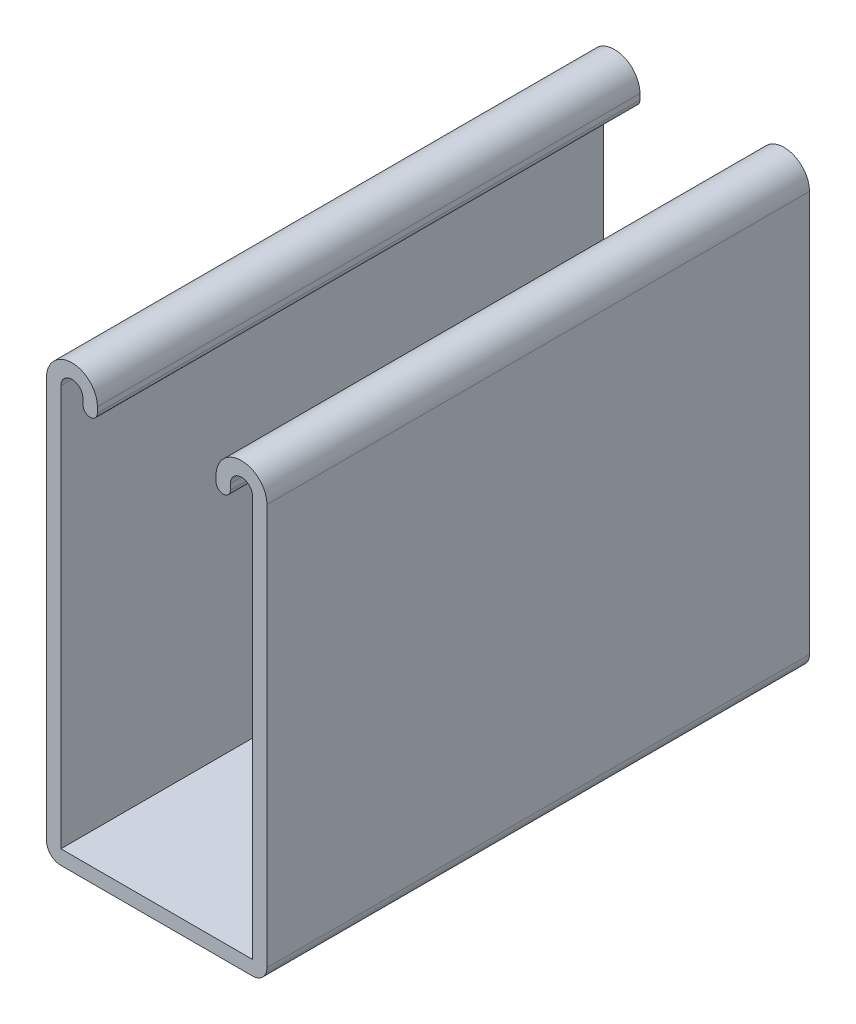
ISO-10303-21;
HEADER;
FILE_DESCRIPTION(('STEP AP214'),'2;1');
FILE_NAME('part.step','',(''),(''),'','','');
FILE_SCHEMA(('AUTOMOTIVE_DESIGN { 1 0 10303 214 1 1 1 1 }'));
ENDSEC;
DATA;
#1=APPLICATION_CONTEXT('core data for automotive mechanical design processes');
#2=APPLICATION_PROTOCOL_DEFINITION('international standard','automotive_design',2000,#1);
#3=PRODUCT_CONTEXT('',#1,'mechanical');
#4=PRODUCT('Part','Part','',(#3));
#5=PRODUCT_RELATED_PRODUCT_CATEGORY('part','',(#4));
#6=PRODUCT_DEFINITION_FORMATION('','',#4);
#7=PRODUCT_DEFINITION_CONTEXT('part definition',#1,'design');
#8=PRODUCT_DEFINITION('design','',#6,#7);
#9=PRODUCT_DEFINITION_SHAPE('','',#8);
#10=(LENGTH_UNIT() NAMED_UNIT(*) SI_UNIT(.MILLI.,.METRE.));
#11=(NAMED_UNIT(*) PLANE_ANGLE_UNIT() SI_UNIT($,.RADIAN.));
#12=(NAMED_UNIT(*) SI_UNIT($,.STERADIAN.) SOLID_ANGLE_UNIT());
#13=UNCERTAINTY_MEASURE_WITH_UNIT(LENGTH_MEASURE(1.E-05),#10,'distance_accuracy_value','');
#14=(GEOMETRIC_REPRESENTATION_CONTEXT(3) GLOBAL_UNCERTAINTY_ASSIGNED_CONTEXT((#13)) GLOBAL_UNIT_ASSIGNED_CONTEXT((#10,
#11,#12)) REPRESENTATION_CONTEXT('',''));
#15=CARTESIAN_POINT('',(0.,0.,0.));
#16=DIRECTION('',(0.,0.,1.));
#17=DIRECTION('',(1.,0.,0.));
#18=AXIS2_PLACEMENT_3D('',#15,#16,#17);
#19=CARTESIAN_POINT('',(-15.875,39.6875,101.6));
#20=DIRECTION('',(0.,0.,-1.));
#21=DIRECTION('',(-1.,0.,0.));
#22=AXIS2_PLACEMENT_3D('',#19,#20,#21);
#23=CYLINDRICAL_SURFACE('',#22,4.7625);
#24=CARTESIAN_POINT('',(-15.875,39.6875,0.));
#25=DIRECTION('',(0.,0.,1.));
#26=DIRECTION('',(-1.,0.,0.));
#27=AXIS2_PLACEMENT_3D('',#24,#25,#26);
#28=CIRCLE('',#27,4.7625);
#29=CARTESIAN_POINT('',(-11.1125,39.6875,0.));
#30=VERTEX_POINT('',#29);
#31=CARTESIAN_POINT('',(-20.6375,39.6875,0.));
#32=VERTEX_POINT('',#31);
#33=EDGE_CURVE('E190',#30,#32,#28,.T.);
#34=ORIENTED_EDGE('',*,*,#33,.T.);
#35=DIRECTION('',(0.,0.,-1.));
#36=VECTOR('',#35,1.);
#37=CARTESIAN_POINT('',(-20.6375,39.6875,101.6));
#38=LINE('',#37,#36);
#39=CARTESIAN_POINT('',(-20.6375,39.6875,101.6));
#40=VERTEX_POINT('',#39);
#41=EDGE_CURVE('E11',#40,#32,#38,.T.);
#42=ORIENTED_EDGE('',*,*,#41,.F.);
#43=CARTESIAN_POINT('',(-15.875,39.6875,101.6));
#44=DIRECTION('',(0.,0.,1.));
#45=DIRECTION('',(-1.,0.,0.));
#46=AXIS2_PLACEMENT_3D('',#43,#44,#45);
#47=CIRCLE('',#46,4.7625);
#48=CARTESIAN_POINT('',(-11.1125,39.6875,101.6));
#49=VERTEX_POINT('',#48);
#50=EDGE_CURVE('E224',#49,#40,#47,.T.);
#51=ORIENTED_EDGE('',*,*,#50,.F.);
#52=DIRECTION('',(0.,0.,-1.));
#53=VECTOR('',#52,1.);
#54=CARTESIAN_POINT('',(-11.1125,39.6875,101.6));
#55=LINE('',#54,#53);
#56=EDGE_CURVE('E186',#49,#30,#55,.T.);
#57=ORIENTED_EDGE('',*,*,#56,.T.);
#58=EDGE_LOOP('',(#34,#42,#51,#57));
#59=FACE_BOUND('',#58,.T.);
#60=ADVANCED_FACE('F33',(#59),#23,.T.);
#61=CARTESIAN_POINT('',(-20.6375,39.6875,101.6));
#62=DIRECTION('',(1.,0.,0.));
#63=DIRECTION('',(0.,1.,0.));
#64=AXIS2_PLACEMENT_3D('',#61,#62,#63);
#65=PLANE('',#64);
#66=DIRECTION('',(0.,-1.,0.));
#67=VECTOR('',#66,1.);
#68=CARTESIAN_POINT('',(-20.6375,39.6875,0.));
#69=LINE('',#68,#67);
#70=CARTESIAN_POINT('',(-20.6375,-35.4076,0.));
#71=VERTEX_POINT('',#70);
#72=EDGE_CURVE('E193',#32,#71,#69,.T.);
#73=ORIENTED_EDGE('',*,*,#72,.T.);
#74=DIRECTION('',(0.,0.,-1.));
#75=VECTOR('',#74,1.);
#76=CARTESIAN_POINT('',(-20.6375,-35.4076,101.6));
#77=LINE('',#76,#75);
#78=CARTESIAN_POINT('',(-20.6375,-35.4076,101.6));
#79=VERTEX_POINT('',#78);
#80=EDGE_CURVE('E42',#79,#71,#77,.T.);
#81=ORIENTED_EDGE('',*,*,#80,.F.);
#82=DIRECTION('',(0.,-1.,0.));
#83=VECTOR('',#82,1.);
#84=CARTESIAN_POINT('',(-20.6375,39.6875,101.6));
#85=LINE('',#84,#83);
#86=EDGE_CURVE('E123',#40,#79,#85,.T.);
#87=ORIENTED_EDGE('',*,*,#86,.F.);
#88=ORIENTED_EDGE('',*,*,#41,.T.);
#89=EDGE_LOOP('',(#73,#81,#87,#88));
#90=FACE_BOUND('',#89,.T.);
#91=ADVANCED_FACE('F333',(#90),#65,.F.);
#92=CARTESIAN_POINT('',(-17.9451,-35.4076,101.6));
#93=DIRECTION('',(0.,0.,-1.));
#94=DIRECTION('',(-1.,0.,0.));
#95=AXIS2_PLACEMENT_3D('',#92,#93,#94);
#96=CYLINDRICAL_SURFACE('',#95,2.6924);
#97=CARTESIAN_POINT('',(-17.9451,-35.4076,0.));
#98=DIRECTION('',(0.,0.,1.));
#99=DIRECTION('',(-1.,0.,0.));
#100=AXIS2_PLACEMENT_3D('',#97,#98,#99);
#101=CIRCLE('',#100,2.6924);
#102=CARTESIAN_POINT('',(-17.9451,-38.1,0.));
#103=VERTEX_POINT('',#102);
#104=EDGE_CURVE('E195',#71,#103,#101,.T.);
#105=ORIENTED_EDGE('',*,*,#104,.T.);
#106=DIRECTION('',(0.,0.,-1.));
#107=VECTOR('',#106,1.);
#108=CARTESIAN_POINT('',(-17.9451,-38.1,101.6));
#109=LINE('',#108,#107);
#110=CARTESIAN_POINT('',(-17.9451,-38.1,101.6));
#111=VERTEX_POINT('',#110);
#112=EDGE_CURVE('E261',#111,#103,#109,.T.);
#113=ORIENTED_EDGE('',*,*,#112,.F.);
#114=CARTESIAN_POINT('',(-17.9451,-35.4076,101.6));
#115=DIRECTION('',(0.,0.,1.));
#116=DIRECTION('',(-1.,0.,0.));
#117=AXIS2_PLACEMENT_3D('',#114,#115,#116);
#118=CIRCLE('',#117,2.6924);
#119=EDGE_CURVE('E270',#79,#111,#118,.T.);
#120=ORIENTED_EDGE('',*,*,#119,.F.);
#121=ORIENTED_EDGE('',*,*,#80,.T.);
#122=EDGE_LOOP('',(#105,#113,#120,#121));
#123=FACE_BOUND('',#122,.T.);
#124=ADVANCED_FACE('F268',(#123),#96,.T.);
#125=CARTESIAN_POINT('',(-17.9451,-38.1,101.6));
#126=DIRECTION('',(0.,1.,0.));
#127=DIRECTION('',(-1.,0.,0.));
#128=AXIS2_PLACEMENT_3D('',#125,#126,#127);
#129=PLANE('',#128);
#130=CARTESIAN_POINT('',(0.,-38.1,71.4375));
#131=DIRECTION('',(0.,-1.,0.));
#132=DIRECTION('',(1.,0.,0.));
#133=AXIS2_PLACEMENT_3D('',#130,#131,#132);
#134=CIRCLE('',#133,7.14375);
#135=CARTESIAN_POINT('',(7.14374999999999,-38.1,71.4375));
#136=VERTEX_POINT('',#135);
#137=EDGE_CURVE('E452',#136,#136,#134,.T.);
#138=ORIENTED_EDGE('',*,*,#137,.F.);
#139=EDGE_LOOP('',(#138));
#140=FACE_BOUND('',#139,.T.);
#141=CARTESIAN_POINT('',(0.,-38.1,23.8125));
#142=DIRECTION('',(0.,-1.,0.));
#143=DIRECTION('',(1.,0.,0.));
#144=AXIS2_PLACEMENT_3D('',#141,#142,#143);
#145=CIRCLE('',#144,7.14375);
#146=CARTESIAN_POINT('',(7.14374999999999,-38.1,23.8125));
#147=VERTEX_POINT('',#146);
#148=EDGE_CURVE('E456',#147,#147,#145,.T.);
#149=ORIENTED_EDGE('',*,*,#148,.F.);
#150=EDGE_LOOP('',(#149));
#151=FACE_BOUND('',#150,.T.);
#152=DIRECTION('',(1.,0.,0.));
#153=VECTOR('',#152,1.);
#154=CARTESIAN_POINT('',(-17.9451,-38.1,0.));
#155=LINE('',#154,#153);
#156=CARTESIAN_POINT('',(17.9451,-38.1,0.));
#157=VERTEX_POINT('',#156);
#158=EDGE_CURVE('E197',#103,#157,#155,.T.);
#159=ORIENTED_EDGE('',*,*,#158,.T.);
#160=DIRECTION('',(0.,0.,-1.));
#161=VECTOR('',#160,1.);
#162=CARTESIAN_POINT('',(17.9451,-38.1,101.6));
#163=LINE('',#162,#161);
#164=CARTESIAN_POINT('',(17.9451,-38.1,101.6));
#165=VERTEX_POINT('',#164);
#166=EDGE_CURVE('E258',#165,#157,#163,.T.);
#167=ORIENTED_EDGE('',*,*,#166,.F.);
#168=DIRECTION('',(1.,0.,0.));
#169=VECTOR('',#168,1.);
#170=CARTESIAN_POINT('',(-17.9451,-38.1,101.6));
#171=LINE('',#170,#169);
#172=EDGE_CURVE('E288',#111,#165,#171,.T.);
#173=ORIENTED_EDGE('',*,*,#172,.F.);
#174=ORIENTED_EDGE('',*,*,#112,.T.);
#175=EDGE_LOOP('',(#159,#167,#173,#174));
#176=FACE_BOUND('',#175,.T.);
#177=ADVANCED_FACE('F279',(#140,#151,#176),#129,.F.);
#178=CARTESIAN_POINT('',(17.9451,-35.4076,101.6));
#179=DIRECTION('',(0.,0.,-1.));
#180=DIRECTION('',(-1.,0.,0.));
#181=AXIS2_PLACEMENT_3D('',#178,#179,#180);
#182=CYLINDRICAL_SURFACE('',#181,2.6924);
#183=CARTESIAN_POINT('',(17.9451,-35.4076,0.));
#184=DIRECTION('',(0.,0.,1.));
#185=DIRECTION('',(1.,0.,0.));
#186=AXIS2_PLACEMENT_3D('',#183,#184,#185);
#187=CIRCLE('',#186,2.6924);
#188=CARTESIAN_POINT('',(20.6375,-35.4076,0.));
#189=VERTEX_POINT('',#188);
#190=EDGE_CURVE('E199',#157,#189,#187,.T.);
#191=ORIENTED_EDGE('',*,*,#190,.T.);
#192=DIRECTION('',(0.,0.,-1.));
#193=VECTOR('',#192,1.);
#194=CARTESIAN_POINT('',(20.6375,-35.4076,101.6));
#195=LINE('',#194,#193);
#196=CARTESIAN_POINT('',(20.6375,-35.4076,101.6));
#197=VERTEX_POINT('',#196);
#198=EDGE_CURVE('E255',#197,#189,#195,.T.);
#199=ORIENTED_EDGE('',*,*,#198,.F.);
#200=CARTESIAN_POINT('',(17.9451,-35.4076,101.6));
#201=DIRECTION('',(0.,0.,1.));
#202=DIRECTION('',(1.,0.,0.));
#203=AXIS2_PLACEMENT_3D('',#200,#201,#202);
#204=CIRCLE('',#203,2.6924);
#205=EDGE_CURVE('E285',#165,#197,#204,.T.);
#206=ORIENTED_EDGE('',*,*,#205,.F.);
#207=ORIENTED_EDGE('',*,*,#166,.T.);
#208=EDGE_LOOP('',(#191,#199,#206,#207));
#209=FACE_BOUND('',#208,.T.);
#210=ADVANCED_FACE('F283',(#209),#182,.T.);
#211=CARTESIAN_POINT('',(20.6375,-35.4076,101.6));
#212=DIRECTION('',(-1.,0.,0.));
#213=DIRECTION('',(0.,-1.,0.));
#214=AXIS2_PLACEMENT_3D('',#211,#212,#213);
#215=PLANE('',#214);
#216=DIRECTION('',(0.,1.,0.));
#217=VECTOR('',#216,1.);
#218=CARTESIAN_POINT('',(20.6375,-35.4076,0.));
#219=LINE('',#218,#217);
#220=CARTESIAN_POINT('',(20.6375,39.6875,0.));
#221=VERTEX_POINT('',#220);
#222=EDGE_CURVE('E201',#189,#221,#219,.T.);
#223=ORIENTED_EDGE('',*,*,#222,.T.);
#224=DIRECTION('',(0.,0.,-1.));
#225=VECTOR('',#224,1.);
#226=CARTESIAN_POINT('',(20.6375,39.6875,101.6));
#227=LINE('',#226,#225);
#228=CARTESIAN_POINT('',(20.6375,39.6875,101.6));
#229=VERTEX_POINT('',#228);
#230=EDGE_CURVE('E252',#229,#221,#227,.T.);
#231=ORIENTED_EDGE('',*,*,#230,.F.);
#232=DIRECTION('',(0.,1.,0.));
#233=VECTOR('',#232,1.);
#234=CARTESIAN_POINT('',(20.6375,-35.4076,101.6));
#235=LINE('',#234,#233);
#236=EDGE_CURVE('E287',#197,#229,#235,.T.);
#237=ORIENTED_EDGE('',*,*,#236,.F.);
#238=ORIENTED_EDGE('',*,*,#198,.T.);
#239=EDGE_LOOP('',(#223,#231,#237,#238));
#240=FACE_BOUND('',#239,.T.);
#241=ADVANCED_FACE('F347',(#240),#215,.F.);
#242=CARTESIAN_POINT('',(15.875,39.6875,101.6));
#243=DIRECTION('',(0.,0.,-1.));
#244=DIRECTION('',(-1.,0.,0.));
#245=AXIS2_PLACEMENT_3D('',#242,#243,#244);
#246=CYLINDRICAL_SURFACE('',#245,4.7625);
#247=CARTESIAN_POINT('',(15.875,39.6875,0.));
#248=DIRECTION('',(0.,0.,1.));
#249=DIRECTION('',(1.,0.,0.));
#250=AXIS2_PLACEMENT_3D('',#247,#248,#249);
#251=CIRCLE('',#250,4.7625);
#252=CARTESIAN_POINT('',(11.1125,39.6875,0.));
#253=VERTEX_POINT('',#252);
#254=EDGE_CURVE('E203',#221,#253,#251,.T.);
#255=ORIENTED_EDGE('',*,*,#254,.T.);
#256=DIRECTION('',(0.,0.,-1.));
#257=VECTOR('',#256,1.);
#258=CARTESIAN_POINT('',(11.1125,39.6875,101.6));
#259=LINE('',#258,#257);
#260=CARTESIAN_POINT('',(11.1125,39.6875,101.6));
#261=VERTEX_POINT('',#260);
#262=EDGE_CURVE('E249',#261,#253,#259,.T.);
#263=ORIENTED_EDGE('',*,*,#262,.F.);
#264=CARTESIAN_POINT('',(15.875,39.6875,101.6));
#265=DIRECTION('',(0.,0.,1.));
#266=DIRECTION('',(1.,0.,0.));
#267=AXIS2_PLACEMENT_3D('',#264,#265,#266);
#268=CIRCLE('',#267,4.7625);
#269=EDGE_CURVE('E290',#229,#261,#268,.T.);
#270=ORIENTED_EDGE('',*,*,#269,.F.);
#271=ORIENTED_EDGE('',*,*,#230,.T.);
#272=EDGE_LOOP('',(#255,#263,#270,#271));
#273=FACE_BOUND('',#272,.T.);
#274=ADVANCED_FACE('F350',(#273),#246,.T.);
#275=CARTESIAN_POINT('',(11.1125,39.6875,101.6));
#276=DIRECTION('',(1.,0.,0.));
#277=DIRECTION('',(0.,1.,0.));
#278=AXIS2_PLACEMENT_3D('',#275,#276,#277);
#279=PLANE('',#278);
#280=DIRECTION('',(0.,-1.,0.));
#281=VECTOR('',#280,1.);
#282=CARTESIAN_POINT('',(11.1125,39.6875,0.));
#283=LINE('',#282,#281);
#284=CARTESIAN_POINT('',(11.1125,38.65245,0.));
#285=VERTEX_POINT('',#284);
#286=EDGE_CURVE('E205',#253,#285,#283,.T.);
#287=ORIENTED_EDGE('',*,*,#286,.T.);
#288=DIRECTION('',(0.,0.,-1.));
#289=VECTOR('',#288,1.);
#290=CARTESIAN_POINT('',(11.1125,38.65245,101.6));
#291=LINE('',#290,#289);
#292=CARTESIAN_POINT('',(11.1125,38.65245,101.6));
#293=VERTEX_POINT('',#292);
#294=EDGE_CURVE('E246',#293,#285,#291,.T.);
#295=ORIENTED_EDGE('',*,*,#294,.F.);
#296=DIRECTION('',(0.,-1.,0.));
#297=VECTOR('',#296,1.);
#298=CARTESIAN_POINT('',(11.1125,39.6875,101.6));
#299=LINE('',#298,#297);
#300=EDGE_CURVE('E296',#261,#293,#299,.T.);
#301=ORIENTED_EDGE('',*,*,#300,.F.);
#302=ORIENTED_EDGE('',*,*,#262,.T.);
#303=EDGE_LOOP('',(#287,#295,#301,#302));
#304=FACE_BOUND('',#303,.T.);
#305=ADVANCED_FACE('F354',(#304),#279,.F.);
#306=CARTESIAN_POINT('',(12.4587,38.65245,101.6));
#307=DIRECTION('',(0.,0.,-1.));
#308=DIRECTION('',(-1.,0.,0.));
#309=AXIS2_PLACEMENT_3D('',#306,#307,#308);
#310=CYLINDRICAL_SURFACE('',#309,1.3462);
#311=CARTESIAN_POINT('',(12.4587,38.65245,0.));
#312=DIRECTION('',(0.,0.,1.));
#313=DIRECTION('',(1.,0.,0.));
#314=AXIS2_PLACEMENT_3D('',#311,#312,#313);
#315=CIRCLE('',#314,1.3462);
#316=CARTESIAN_POINT('',(13.8049,38.65245,0.));
#317=VERTEX_POINT('',#316);
#318=EDGE_CURVE('E207',#285,#317,#315,.T.);
#319=ORIENTED_EDGE('',*,*,#318,.T.);
#320=DIRECTION('',(0.,0.,-1.));
#321=VECTOR('',#320,1.);
#322=CARTESIAN_POINT('',(13.8049,38.65245,101.6));
#323=LINE('',#322,#321);
#324=CARTESIAN_POINT('',(13.8049,38.65245,101.6));
#325=VERTEX_POINT('',#324);
#326=EDGE_CURVE('E243',#325,#317,#323,.T.);
#327=ORIENTED_EDGE('',*,*,#326,.F.);
#328=CARTESIAN_POINT('',(12.4587,38.65245,101.6));
#329=DIRECTION('',(0.,0.,1.));
#330=DIRECTION('',(1.,0.,0.));
#331=AXIS2_PLACEMENT_3D('',#328,#329,#330);
#332=CIRCLE('',#331,1.3462);
#333=EDGE_CURVE('E298',#293,#325,#332,.T.);
#334=ORIENTED_EDGE('',*,*,#333,.F.);
#335=ORIENTED_EDGE('',*,*,#294,.T.);
#336=EDGE_LOOP('',(#319,#327,#334,#335));
#337=FACE_BOUND('',#336,.T.);
#338=ADVANCED_FACE('F358',(#337),#310,.T.);
#339=CARTESIAN_POINT('',(13.8049,39.6875,101.6));
#340=DIRECTION('',(-1.,0.,0.));
#341=DIRECTION('',(0.,0.,1.));
#342=AXIS2_PLACEMENT_3D('',#339,#340,#341);
#343=PLANE('',#342);
#344=DIRECTION('',(0.,1.,0.));
#345=VECTOR('',#344,1.);
#346=CARTESIAN_POINT('',(13.8049,39.6875,0.));
#347=LINE('',#346,#345);
#348=CARTESIAN_POINT('',(13.8049,39.6875,0.));
#349=VERTEX_POINT('',#348);
#350=EDGE_CURVE('E209',#317,#349,#347,.T.);
#351=ORIENTED_EDGE('',*,*,#350,.T.);
#352=DIRECTION('',(0.,0.,-1.));
#353=VECTOR('',#352,1.);
#354=CARTESIAN_POINT('',(13.8049,39.6875,101.6));
#355=LINE('',#354,#353);
#356=CARTESIAN_POINT('',(13.8049,39.6875,101.6));
#357=VERTEX_POINT('',#356);
#358=EDGE_CURVE('E240',#357,#349,#355,.T.);
#359=ORIENTED_EDGE('',*,*,#358,.F.);
#360=DIRECTION('',(0.,1.,0.));
#361=VECTOR('',#360,1.);
#362=CARTESIAN_POINT('',(13.8049,39.6875,101.6));
#363=LINE('',#362,#361);
#364=EDGE_CURVE('E300',#325,#357,#363,.T.);
#365=ORIENTED_EDGE('',*,*,#364,.F.);
#366=ORIENTED_EDGE('',*,*,#326,.T.);
#367=EDGE_LOOP('',(#351,#359,#365,#366));
#368=FACE_BOUND('',#367,.T.);
#369=ADVANCED_FACE('F362',(#368),#343,.F.);
#370=CARTESIAN_POINT('',(15.875,39.6875,101.6));
#371=DIRECTION('',(0.,0.,-1.));
#372=DIRECTION('',(-1.,0.,0.));
#373=AXIS2_PLACEMENT_3D('',#370,#371,#372);
#374=CYLINDRICAL_SURFACE('',#373,2.07010000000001);
#375=CARTESIAN_POINT('',(15.875,39.6875,0.));
#376=DIRECTION('',(0.,0.,-1.));
#377=DIRECTION('',(1.,0.,0.));
#378=AXIS2_PLACEMENT_3D('',#375,#376,#377);
#379=CIRCLE('',#378,2.07010000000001);
#380=CARTESIAN_POINT('',(17.9451,39.6875,0.));
#381=VERTEX_POINT('',#380);
#382=EDGE_CURVE('E211',#349,#381,#379,.T.);
#383=ORIENTED_EDGE('',*,*,#382,.T.);
#384=DIRECTION('',(0.,0.,-1.));
#385=VECTOR('',#384,1.);
#386=CARTESIAN_POINT('',(17.9451,39.6875,101.6));
#387=LINE('',#386,#385);
#388=CARTESIAN_POINT('',(17.9451,39.6875,101.6));
#389=VERTEX_POINT('',#388);
#390=EDGE_CURVE('E237',#389,#381,#387,.T.);
#391=ORIENTED_EDGE('',*,*,#390,.F.);
#392=CARTESIAN_POINT('',(15.875,39.6875,101.6));
#393=DIRECTION('',(0.,0.,-1.));
#394=DIRECTION('',(1.,0.,0.));
#395=AXIS2_PLACEMENT_3D('',#392,#393,#394);
#396=CIRCLE('',#395,2.07010000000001);
#397=EDGE_CURVE('E302',#357,#389,#396,.T.);
#398=ORIENTED_EDGE('',*,*,#397,.F.);
#399=ORIENTED_EDGE('',*,*,#358,.T.);
#400=EDGE_LOOP('',(#383,#391,#398,#399));
#401=FACE_BOUND('',#400,.T.);
#402=ADVANCED_FACE('F366',(#401),#374,.F.);
#403=CARTESIAN_POINT('',(17.9451,-35.4076,101.6));
#404=DIRECTION('',(1.,0.,0.));
#405=DIRECTION('',(0.,0.,-1.));
#406=AXIS2_PLACEMENT_3D('',#403,#404,#405);
#407=PLANE('',#406);
#408=DIRECTION('',(0.,-1.,0.));
#409=VECTOR('',#408,1.);
#410=CARTESIAN_POINT('',(17.9451,-35.4076,0.));
#411=LINE('',#410,#409);
#412=CARTESIAN_POINT('',(17.9451,-35.4076,0.));
#413=VERTEX_POINT('',#412);
#414=EDGE_CURVE('E213',#381,#413,#411,.T.);
#415=ORIENTED_EDGE('',*,*,#414,.T.);
#416=DIRECTION('',(0.,0.,-1.));
#417=VECTOR('',#416,1.);
#418=CARTESIAN_POINT('',(17.9451,-35.4076,101.6));
#419=LINE('',#418,#417);
#420=CARTESIAN_POINT('',(17.9451,-35.4076,101.6));
#421=VERTEX_POINT('',#420);
#422=EDGE_CURVE('E234',#421,#413,#419,.T.);
#423=ORIENTED_EDGE('',*,*,#422,.F.);
#424=DIRECTION('',(0.,-1.,0.));
#425=VECTOR('',#424,1.);
#426=CARTESIAN_POINT('',(17.9451,-35.4076,101.6));
#427=LINE('',#426,#425);
#428=EDGE_CURVE('E304',#389,#421,#427,.T.);
#429=ORIENTED_EDGE('',*,*,#428,.F.);
#430=ORIENTED_EDGE('',*,*,#390,.T.);
#431=EDGE_LOOP('',(#415,#423,#429,#430));
#432=FACE_BOUND('',#431,.T.);
#433=ADVANCED_FACE('F370',(#432),#407,.F.);
#434=CARTESIAN_POINT('',(-17.9451,-35.4076,101.6));
#435=DIRECTION('',(0.,-1.,0.));
#436=DIRECTION('',(0.,0.,-1.));
#437=AXIS2_PLACEMENT_3D('',#434,#435,#436);
#438=PLANE('',#437);
#439=CARTESIAN_POINT('',(0.,-35.4076,71.4375));
#440=DIRECTION('',(0.,-1.,0.));
#441=DIRECTION('',(0.,0.,-1.));
#442=AXIS2_PLACEMENT_3D('',#439,#440,#441);
#443=CIRCLE('',#442,7.14375);
#444=CARTESIAN_POINT('',(0.,-35.4076,64.29375));
#445=VERTEX_POINT('',#444);
#446=EDGE_CURVE('E455',#445,#445,#443,.T.);
#447=ORIENTED_EDGE('',*,*,#446,.T.);
#448=EDGE_LOOP('',(#447));
#449=FACE_BOUND('',#448,.T.);
#450=CARTESIAN_POINT('',(0.,-35.4076,23.8125));
#451=DIRECTION('',(0.,-1.,0.));
#452=DIRECTION('',(0.,0.,-1.));
#453=AXIS2_PLACEMENT_3D('',#450,#451,#452);
#454=CIRCLE('',#453,7.14375);
#455=CARTESIAN_POINT('',(0.,-35.4076,16.66875));
#456=VERTEX_POINT('',#455);
#457=EDGE_CURVE('E36',#456,#456,#454,.T.);
#458=ORIENTED_EDGE('',*,*,#457,.T.);
#459=EDGE_LOOP('',(#458));
#460=FACE_BOUND('',#459,.T.);
#461=DIRECTION('',(-1.,0.,0.));
#462=VECTOR('',#461,1.);
#463=CARTESIAN_POINT('',(-17.9451,-35.4076,0.));
#464=LINE('',#463,#462);
#465=CARTESIAN_POINT('',(-17.9451,-35.4076,0.));
#466=VERTEX_POINT('',#465);
#467=EDGE_CURVE('E215',#413,#466,#464,.T.);
#468=ORIENTED_EDGE('',*,*,#467,.T.);
#469=DIRECTION('',(0.,0.,-1.));
#470=VECTOR('',#469,1.);
#471=CARTESIAN_POINT('',(-17.9451,-35.4076,101.6));
#472=LINE('',#471,#470);
#473=CARTESIAN_POINT('',(-17.9451,-35.4076,101.6));
#474=VERTEX_POINT('',#473);
#475=EDGE_CURVE('E231',#474,#466,#472,.T.);
#476=ORIENTED_EDGE('',*,*,#475,.F.);
#477=DIRECTION('',(-1.,0.,0.));
#478=VECTOR('',#477,1.);
#479=CARTESIAN_POINT('',(-17.9451,-35.4076,101.6));
#480=LINE('',#479,#478);
#481=EDGE_CURVE('E306',#421,#474,#480,.T.);
#482=ORIENTED_EDGE('',*,*,#481,.F.);
#483=ORIENTED_EDGE('',*,*,#422,.T.);
#484=EDGE_LOOP('',(#468,#476,#482,#483));
#485=FACE_BOUND('',#484,.T.);
#486=ADVANCED_FACE('F374',(#449,#460,#485),#438,.F.);
#487=CARTESIAN_POINT('',(-17.9451,39.6875,101.6));
#488=DIRECTION('',(-1.,0.,0.));
#489=DIRECTION('',(0.,-1.,0.));
#490=AXIS2_PLACEMENT_3D('',#487,#488,#489);
#491=PLANE('',#490);
#492=DIRECTION('',(0.,1.,0.));
#493=VECTOR('',#492,1.);
#494=CARTESIAN_POINT('',(-17.9451,39.6875,0.));
#495=LINE('',#494,#493);
#496=CARTESIAN_POINT('',(-17.9451,39.6875,0.));
#497=VERTEX_POINT('',#496);
#498=EDGE_CURVE('E217',#466,#497,#495,.T.);
#499=ORIENTED_EDGE('',*,*,#498,.T.);
#500=DIRECTION('',(0.,0.,-1.));
#501=VECTOR('',#500,1.);
#502=CARTESIAN_POINT('',(-17.9451,39.6875,101.6));
#503=LINE('',#502,#501);
#504=CARTESIAN_POINT('',(-17.9451,39.6875,101.6));
#505=VERTEX_POINT('',#504);
#506=EDGE_CURVE('E228',#505,#497,#503,.T.);
#507=ORIENTED_EDGE('',*,*,#506,.F.);
#508=DIRECTION('',(0.,1.,0.));
#509=VECTOR('',#508,1.);
#510=CARTESIAN_POINT('',(-17.9451,39.6875,101.6));
#511=LINE('',#510,#509);
#512=EDGE_CURVE('E308',#474,#505,#511,.T.);
#513=ORIENTED_EDGE('',*,*,#512,.F.);
#514=ORIENTED_EDGE('',*,*,#475,.T.);
#515=EDGE_LOOP('',(#499,#507,#513,#514));
#516=FACE_BOUND('',#515,.T.);
#517=ADVANCED_FACE('F314',(#516),#491,.F.);
#518=CARTESIAN_POINT('',(-15.875,39.6875,101.6));
#519=DIRECTION('',(0.,0.,-1.));
#520=DIRECTION('',(-1.,0.,0.));
#521=AXIS2_PLACEMENT_3D('',#518,#519,#520);
#522=CYLINDRICAL_SURFACE('',#521,2.0701);
#523=CARTESIAN_POINT('',(-15.875,39.6875,0.));
#524=DIRECTION('',(0.,0.,-1.));
#525=DIRECTION('',(-1.,0.,0.));
#526=AXIS2_PLACEMENT_3D('',#523,#524,#525);
#527=CIRCLE('',#526,2.0701);
#528=CARTESIAN_POINT('',(-13.8049,39.6875,0.));
#529=VERTEX_POINT('',#528);
#530=EDGE_CURVE('E219',#497,#529,#527,.T.);
#531=ORIENTED_EDGE('',*,*,#530,.T.);
#532=DIRECTION('',(0.,0.,-1.));
#533=VECTOR('',#532,1.);
#534=CARTESIAN_POINT('',(-13.8049,39.6875,101.6));
#535=LINE('',#534,#533);
#536=CARTESIAN_POINT('',(-13.8049,39.6875,101.6));
#537=VERTEX_POINT('',#536);
#538=EDGE_CURVE('E181',#537,#529,#535,.T.);
#539=ORIENTED_EDGE('',*,*,#538,.F.);
#540=CARTESIAN_POINT('',(-15.875,39.6875,101.6));
#541=DIRECTION('',(0.,0.,-1.));
#542=DIRECTION('',(-1.,0.,0.));
#543=AXIS2_PLACEMENT_3D('',#540,#541,#542);
#544=CIRCLE('',#543,2.0701);
#545=EDGE_CURVE('E172',#505,#537,#544,.T.);
#546=ORIENTED_EDGE('',*,*,#545,.F.);
#547=ORIENTED_EDGE('',*,*,#506,.T.);
#548=EDGE_LOOP('',(#531,#539,#546,#547));
#549=FACE_BOUND('',#548,.T.);
#550=ADVANCED_FACE('F318',(#549),#522,.F.);
#551=CARTESIAN_POINT('',(-13.8049,39.6875,101.6));
#552=DIRECTION('',(1.,0.,0.));
#553=DIRECTION('',(0.,1.,0.));
#554=AXIS2_PLACEMENT_3D('',#551,#552,#553);
#555=PLANE('',#554);
#556=DIRECTION('',(0.,-1.,0.));
#557=VECTOR('',#556,1.);
#558=CARTESIAN_POINT('',(-13.8049,39.6875,0.));
#559=LINE('',#558,#557);
#560=CARTESIAN_POINT('',(-13.8049,38.65245,0.));
#561=VERTEX_POINT('',#560);
#562=EDGE_CURVE('E180',#529,#561,#559,.T.);
#563=ORIENTED_EDGE('',*,*,#562,.T.);
#564=DIRECTION('',(0.,0.,-1.));
#565=VECTOR('',#564,1.);
#566=CARTESIAN_POINT('',(-13.8049,38.65245,101.6));
#567=LINE('',#566,#565);
#568=CARTESIAN_POINT('',(-13.8049,38.65245,101.6));
#569=VERTEX_POINT('',#568);
#570=EDGE_CURVE('E177',#569,#561,#567,.T.);
#571=ORIENTED_EDGE('',*,*,#570,.F.);
#572=DIRECTION('',(0.,-1.,0.));
#573=VECTOR('',#572,1.);
#574=CARTESIAN_POINT('',(-13.8049,39.6875,101.6));
#575=LINE('',#574,#573);
#576=EDGE_CURVE('E166',#537,#569,#575,.T.);
#577=ORIENTED_EDGE('',*,*,#576,.F.);
#578=ORIENTED_EDGE('',*,*,#538,.T.);
#579=EDGE_LOOP('',(#563,#571,#577,#578));
#580=FACE_BOUND('',#579,.T.);
#581=ADVANCED_FACE('F178',(#580),#555,.F.);
#582=CARTESIAN_POINT('',(-12.4587,38.65245,101.6));
#583=DIRECTION('',(0.,0.,-1.));
#584=DIRECTION('',(-1.,0.,0.));
#585=AXIS2_PLACEMENT_3D('',#582,#583,#584);
#586=CYLINDRICAL_SURFACE('',#585,1.3462);
#587=CARTESIAN_POINT('',(-12.4587,38.65245,0.));
#588=DIRECTION('',(0.,0.,1.));
#589=DIRECTION('',(-1.,0.,0.));
#590=AXIS2_PLACEMENT_3D('',#587,#588,#589);
#591=CIRCLE('',#590,1.3462);
#592=CARTESIAN_POINT('',(-11.1125,38.65245,0.));
#593=VERTEX_POINT('',#592);
#594=EDGE_CURVE('E109',#561,#593,#591,.T.);
#595=ORIENTED_EDGE('',*,*,#594,.T.);
#596=DIRECTION('',(0.,0.,-1.));
#597=VECTOR('',#596,1.);
#598=CARTESIAN_POINT('',(-11.1125,38.65245,101.6));
#599=LINE('',#598,#597);
#600=CARTESIAN_POINT('',(-11.1125,38.65245,101.6));
#601=VERTEX_POINT('',#600);
#602=EDGE_CURVE('E182',#601,#593,#599,.T.);
#603=ORIENTED_EDGE('',*,*,#602,.F.);
#604=CARTESIAN_POINT('',(-12.4587,38.65245,101.6));
#605=DIRECTION('',(0.,0.,1.));
#606=DIRECTION('',(-1.,0.,0.));
#607=AXIS2_PLACEMENT_3D('',#604,#605,#606);
#608=CIRCLE('',#607,1.3462);
#609=EDGE_CURVE('E170',#569,#601,#608,.T.);
#610=ORIENTED_EDGE('',*,*,#609,.F.);
#611=ORIENTED_EDGE('',*,*,#570,.T.);
#612=EDGE_LOOP('',(#595,#603,#610,#611));
#613=FACE_BOUND('',#612,.T.);
#614=ADVANCED_FACE('F184',(#613),#586,.T.);
#615=CARTESIAN_POINT('',(-11.1125,39.6875,101.6));
#616=DIRECTION('',(-1.,0.,0.));
#617=DIRECTION('',(0.,-1.,0.));
#618=AXIS2_PLACEMENT_3D('',#615,#616,#617);
#619=PLANE('',#618);
#620=DIRECTION('',(0.,1.,0.));
#621=VECTOR('',#620,1.);
#622=CARTESIAN_POINT('',(-11.1125,39.6875,0.));
#623=LINE('',#622,#621);
#624=EDGE_CURVE('E115',#593,#30,#623,.T.);
#625=ORIENTED_EDGE('',*,*,#624,.T.);
#626=ORIENTED_EDGE('',*,*,#56,.F.);
#627=DIRECTION('',(0.,1.,0.));
#628=VECTOR('',#627,1.);
#629=CARTESIAN_POINT('',(-11.1125,39.6875,101.6));
#630=LINE('',#629,#628);
#631=EDGE_CURVE('E50',#601,#49,#630,.T.);
#632=ORIENTED_EDGE('',*,*,#631,.F.);
#633=ORIENTED_EDGE('',*,*,#602,.T.);
#634=EDGE_LOOP('',(#625,#626,#632,#633));
#635=FACE_BOUND('',#634,.T.);
#636=ADVANCED_FACE('F322',(#635),#619,.F.);
#637=CARTESIAN_POINT('',(-15.875,39.6875,101.6));
#638=DIRECTION('',(0.,0.,-1.));
#639=DIRECTION('',(-1.,0.,0.));
#640=AXIS2_PLACEMENT_3D('',#637,#638,#639);
#641=PLANE('',#640);
#642=ORIENTED_EDGE('',*,*,#50,.T.);
#643=ORIENTED_EDGE('',*,*,#86,.T.);
#644=ORIENTED_EDGE('',*,*,#119,.T.);
#645=ORIENTED_EDGE('',*,*,#172,.T.);
#646=ORIENTED_EDGE('',*,*,#205,.T.);
#647=ORIENTED_EDGE('',*,*,#236,.T.);
#648=ORIENTED_EDGE('',*,*,#269,.T.);
#649=ORIENTED_EDGE('',*,*,#300,.T.);
#650=ORIENTED_EDGE('',*,*,#333,.T.);
#651=ORIENTED_EDGE('',*,*,#364,.T.);
#652=ORIENTED_EDGE('',*,*,#397,.T.);
#653=ORIENTED_EDGE('',*,*,#428,.T.);
#654=ORIENTED_EDGE('',*,*,#481,.T.);
#655=ORIENTED_EDGE('',*,*,#512,.T.);
#656=ORIENTED_EDGE('',*,*,#545,.T.);
#657=ORIENTED_EDGE('',*,*,#576,.T.);
#658=ORIENTED_EDGE('',*,*,#609,.T.);
#659=ORIENTED_EDGE('',*,*,#631,.T.);
#660=EDGE_LOOP('',(#642,#643,#644,#645,#646,#647,#648,#649,#650,#651,#652,#653,#654,#655,#656,
#657,#658,#659));
#661=FACE_BOUND('',#660,.T.);
#662=ADVANCED_FACE('F168',(#661),#641,.F.);
#663=CARTESIAN_POINT('',(-15.875,39.6875,0.));
#664=DIRECTION('',(0.,0.,-1.));
#665=DIRECTION('',(-1.,0.,0.));
#666=AXIS2_PLACEMENT_3D('',#663,#664,#665);
#667=PLANE('',#666);
#668=ORIENTED_EDGE('',*,*,#33,.F.);
#669=ORIENTED_EDGE('',*,*,#624,.F.);
#670=ORIENTED_EDGE('',*,*,#594,.F.);
#671=ORIENTED_EDGE('',*,*,#562,.F.);
#672=ORIENTED_EDGE('',*,*,#530,.F.);
#673=ORIENTED_EDGE('',*,*,#498,.F.);
#674=ORIENTED_EDGE('',*,*,#467,.F.);
#675=ORIENTED_EDGE('',*,*,#414,.F.);
#676=ORIENTED_EDGE('',*,*,#382,.F.);
#677=ORIENTED_EDGE('',*,*,#350,.F.);
#678=ORIENTED_EDGE('',*,*,#318,.F.);
#679=ORIENTED_EDGE('',*,*,#286,.F.);
#680=ORIENTED_EDGE('',*,*,#254,.F.);
#681=ORIENTED_EDGE('',*,*,#222,.F.);
#682=ORIENTED_EDGE('',*,*,#190,.F.);
#683=ORIENTED_EDGE('',*,*,#158,.F.);
#684=ORIENTED_EDGE('',*,*,#104,.F.);
#685=ORIENTED_EDGE('',*,*,#72,.F.);
#686=EDGE_LOOP('',(#668,#669,#670,#671,#672,#673,#674,#675,#676,#677,#678,#679,#680,#681,#682,
#683,#684,#685));
#687=FACE_BOUND('',#686,.T.);
#688=ADVANCED_FACE('F274',(#687),#667,.T.);
#689=CARTESIAN_POINT('',(0.,44.45,23.8125));
#690=DIRECTION('',(0.,-1.,0.));
#691=DIRECTION('',(1.,0.,0.));
#692=AXIS2_PLACEMENT_3D('',#689,#690,#691);
#693=CYLINDRICAL_SURFACE('',#692,7.14375);
#694=ORIENTED_EDGE('',*,*,#148,.T.);
#695=EDGE_LOOP('',(#694));
#696=FACE_BOUND('',#695,.T.);
#697=ORIENTED_EDGE('',*,*,#457,.F.);
#698=EDGE_LOOP('',(#697));
#699=FACE_BOUND('',#698,.T.);
#700=ADVANCED_FACE('F411',(#696,#699),#693,.F.);
#701=CARTESIAN_POINT('',(0.,44.45,71.4375));
#702=DIRECTION('',(0.,-1.,0.));
#703=DIRECTION('',(1.,0.,0.));
#704=AXIS2_PLACEMENT_3D('',#701,#702,#703);
#705=CYLINDRICAL_SURFACE('',#704,7.14375);
#706=ORIENTED_EDGE('',*,*,#137,.T.);
#707=EDGE_LOOP('',(#706));
#708=FACE_BOUND('',#707,.T.);
#709=ORIENTED_EDGE('',*,*,#446,.F.);
#710=EDGE_LOOP('',(#709));
#711=FACE_BOUND('',#710,.T.);
#712=ADVANCED_FACE('F419',(#708,#711),#705,.F.);
#713=CLOSED_SHELL('',(#60,#91,#124,#177,#210,#241,#274,#305,#338,#369,#402,#433,#486,#517,#550,
#581,#614,#636,#662,#688,#700,#712));
#714=MANIFOLD_SOLID_BREP('B2',#713);
#715=ADVANCED_BREP_SHAPE_REPRESENTATION('',(#18,#714),#14);
#716=SHAPE_DEFINITION_REPRESENTATION(#9,#715);
ENDSEC;
END-ISO-10303-21;
